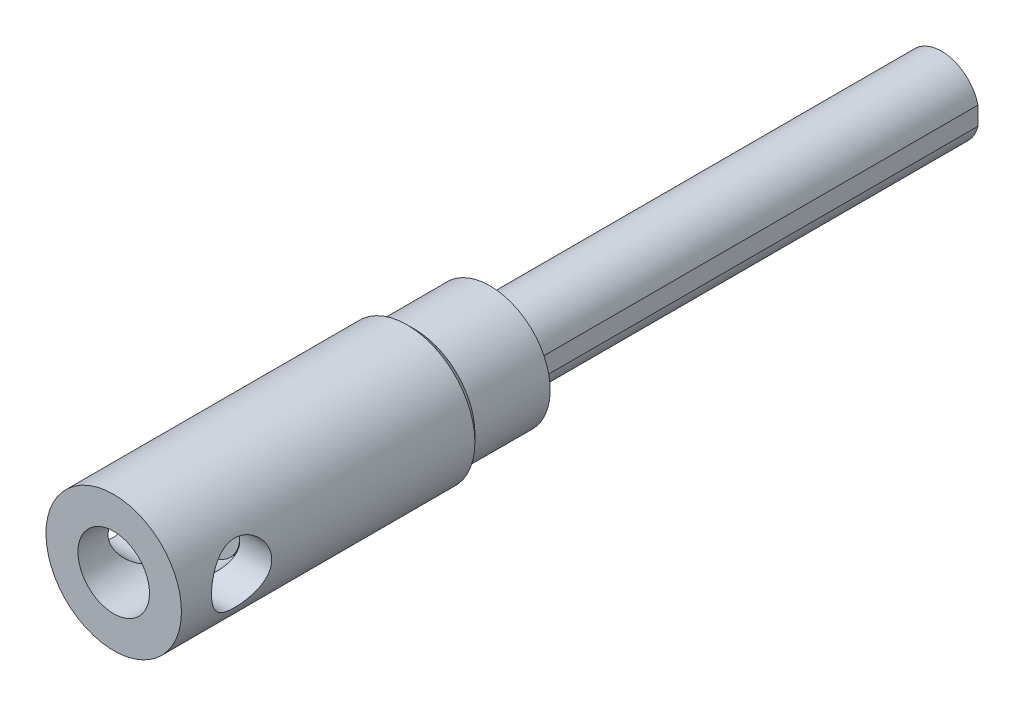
ISO-10303-21;
HEADER;
FILE_DESCRIPTION(('STEP AP214'),'2;1');
FILE_NAME('part.step','',(''),(''),'','','');
FILE_SCHEMA(('AUTOMOTIVE_DESIGN { 1 0 10303 214 1 1 1 1 }'));
ENDSEC;
DATA;
#1=APPLICATION_CONTEXT('core data for automotive mechanical design processes');
#2=APPLICATION_PROTOCOL_DEFINITION('international standard','automotive_design',2000,#1);
#3=PRODUCT_CONTEXT('',#1,'mechanical');
#4=PRODUCT('Part','Part','',(#3));
#5=PRODUCT_RELATED_PRODUCT_CATEGORY('part','',(#4));
#6=PRODUCT_DEFINITION_FORMATION('','',#4);
#7=PRODUCT_DEFINITION_CONTEXT('part definition',#1,'design');
#8=PRODUCT_DEFINITION('design','',#6,#7);
#9=PRODUCT_DEFINITION_SHAPE('','',#8);
#10=(LENGTH_UNIT() NAMED_UNIT(*) SI_UNIT(.MILLI.,.METRE.));
#11=(NAMED_UNIT(*) PLANE_ANGLE_UNIT() SI_UNIT($,.RADIAN.));
#12=(NAMED_UNIT(*) SI_UNIT($,.STERADIAN.) SOLID_ANGLE_UNIT());
#13=UNCERTAINTY_MEASURE_WITH_UNIT(LENGTH_MEASURE(1.E-05),#10,'distance_accuracy_value','');
#14=(GEOMETRIC_REPRESENTATION_CONTEXT(3) GLOBAL_UNCERTAINTY_ASSIGNED_CONTEXT((#13)) GLOBAL_UNIT_ASSIGNED_CONTEXT((#10,
#11,#12)) REPRESENTATION_CONTEXT('',''));
#15=CARTESIAN_POINT('',(0.,0.,0.));
#16=DIRECTION('',(0.,0.,1.));
#17=DIRECTION('',(1.,0.,0.));
#18=AXIS2_PLACEMENT_3D('',#15,#16,#17);
#19=CARTESIAN_POINT('',(2.3094010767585,0.,95.));
#20=DIRECTION('',(-0.866025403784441,0.5,0.));
#21=DIRECTION('',(-0.5,-0.866025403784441,0.));
#22=AXIS2_PLACEMENT_3D('',#19,#20,#21);
#23=PLANE('',#22);
#24=DIRECTION('',(0.,0.,1.));
#25=VECTOR('',#24,1.);
#26=CARTESIAN_POINT('',(1.15470053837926,-2.,95.));
#27=LINE('',#26,#25);
#28=CARTESIAN_POINT('',(1.15470053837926,-2.,95.));
#29=VERTEX_POINT('',#28);
#30=CARTESIAN_POINT('',(1.15470053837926,-2.,97.5));
#31=VERTEX_POINT('',#30);
#32=EDGE_CURVE('E291',#29,#31,#27,.T.);
#33=ORIENTED_EDGE('',*,*,#32,.T.);
#34=DIRECTION('',(-0.5,-0.866025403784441,0.));
#35=VECTOR('',#34,1.);
#36=CARTESIAN_POINT('',(2.3094010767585,0.,97.5));
#37=LINE('',#36,#35);
#38=CARTESIAN_POINT('',(2.3094010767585,0.,97.5));
#39=VERTEX_POINT('',#38);
#40=EDGE_CURVE('E29',#39,#31,#37,.T.);
#41=ORIENTED_EDGE('',*,*,#40,.F.);
#42=DIRECTION('',(0.,0.,1.));
#43=VECTOR('',#42,1.);
#44=CARTESIAN_POINT('',(2.3094010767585,0.,95.));
#45=LINE('',#44,#43);
#46=CARTESIAN_POINT('',(2.3094010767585,0.,95.));
#47=VERTEX_POINT('',#46);
#48=EDGE_CURVE('E33',#47,#39,#45,.T.);
#49=ORIENTED_EDGE('',*,*,#48,.F.);
#50=DIRECTION('',(-0.5,-0.866025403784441,0.));
#51=VECTOR('',#50,1.);
#52=CARTESIAN_POINT('',(2.3094010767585,0.,95.));
#53=LINE('',#52,#51);
#54=EDGE_CURVE('E252',#47,#29,#53,.T.);
#55=ORIENTED_EDGE('',*,*,#54,.T.);
#56=EDGE_LOOP('',(#33,#41,#49,#55));
#57=FACE_BOUND('',#56,.T.);
#58=ADVANCED_FACE('F14',(#57),#23,.T.);
#59=CARTESIAN_POINT('',(-1.15470053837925,-2.,95.));
#60=DIRECTION('',(0.,-1.,0.));
#61=DIRECTION('',(0.,0.,-1.));
#62=AXIS2_PLACEMENT_3D('',#59,#60,#61);
#63=PLANE('',#62);
#64=DIRECTION('',(0.,0.,1.));
#65=VECTOR('',#64,1.);
#66=CARTESIAN_POINT('',(-1.15470053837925,-2.,95.));
#67=LINE('',#66,#65);
#68=CARTESIAN_POINT('',(-1.15470053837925,-2.,95.));
#69=VERTEX_POINT('',#68);
#70=CARTESIAN_POINT('',(-1.15470053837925,-2.,97.5));
#71=VERTEX_POINT('',#70);
#72=EDGE_CURVE('E289',#69,#71,#67,.T.);
#73=ORIENTED_EDGE('',*,*,#72,.T.);
#74=DIRECTION('',(1.,0.,0.));
#75=VECTOR('',#74,1.);
#76=CARTESIAN_POINT('',(-1.15470053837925,-2.,97.5));
#77=LINE('',#76,#75);
#78=EDGE_CURVE('E262',#71,#31,#77,.T.);
#79=ORIENTED_EDGE('',*,*,#78,.T.);
#80=ORIENTED_EDGE('',*,*,#32,.F.);
#81=DIRECTION('',(1.,0.,0.));
#82=VECTOR('',#81,1.);
#83=CARTESIAN_POINT('',(-1.15470053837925,-2.,95.));
#84=LINE('',#83,#82);
#85=EDGE_CURVE('E278',#69,#29,#84,.T.);
#86=ORIENTED_EDGE('',*,*,#85,.F.);
#87=EDGE_LOOP('',(#73,#79,#80,#86));
#88=FACE_BOUND('',#87,.T.);
#89=ADVANCED_FACE('F166',(#88),#63,.F.);
#90=CARTESIAN_POINT('',(-2.3094010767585,0.,95.));
#91=DIRECTION('',(-0.866025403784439,-0.5,0.));
#92=DIRECTION('',(0.5,-0.866025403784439,0.));
#93=AXIS2_PLACEMENT_3D('',#90,#91,#92);
#94=PLANE('',#93);
#95=DIRECTION('',(0.,0.,1.));
#96=VECTOR('',#95,1.);
#97=CARTESIAN_POINT('',(-2.3094010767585,0.,95.));
#98=LINE('',#97,#96);
#99=CARTESIAN_POINT('',(-2.3094010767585,0.,95.));
#100=VERTEX_POINT('',#99);
#101=CARTESIAN_POINT('',(-2.3094010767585,0.,97.5));
#102=VERTEX_POINT('',#101);
#103=EDGE_CURVE('E287',#100,#102,#98,.T.);
#104=ORIENTED_EDGE('',*,*,#103,.T.);
#105=DIRECTION('',(0.5,-0.866025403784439,0.));
#106=VECTOR('',#105,1.);
#107=CARTESIAN_POINT('',(-2.3094010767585,0.,97.5));
#108=LINE('',#107,#106);
#109=EDGE_CURVE('E259',#102,#71,#108,.T.);
#110=ORIENTED_EDGE('',*,*,#109,.T.);
#111=ORIENTED_EDGE('',*,*,#72,.F.);
#112=DIRECTION('',(0.5,-0.866025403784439,0.));
#113=VECTOR('',#112,1.);
#114=CARTESIAN_POINT('',(-2.3094010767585,0.,95.));
#115=LINE('',#114,#113);
#116=EDGE_CURVE('E275',#100,#69,#115,.T.);
#117=ORIENTED_EDGE('',*,*,#116,.F.);
#118=EDGE_LOOP('',(#104,#110,#111,#117));
#119=FACE_BOUND('',#118,.T.);
#120=ADVANCED_FACE('F171',(#119),#94,.F.);
#121=CARTESIAN_POINT('',(-2.3094010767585,0.,95.));
#122=DIRECTION('',(0.866025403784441,-0.5,0.));
#123=DIRECTION('',(0.5,0.866025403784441,0.));
#124=AXIS2_PLACEMENT_3D('',#121,#122,#123);
#125=PLANE('',#124);
#126=DIRECTION('',(0.,0.,1.));
#127=VECTOR('',#126,1.);
#128=CARTESIAN_POINT('',(-1.15470053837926,2.,95.));
#129=LINE('',#128,#127);
#130=CARTESIAN_POINT('',(-1.15470053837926,2.,95.));
#131=VERTEX_POINT('',#130);
#132=CARTESIAN_POINT('',(-1.15470053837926,2.,97.5));
#133=VERTEX_POINT('',#132);
#134=EDGE_CURVE('E285',#131,#133,#129,.T.);
#135=ORIENTED_EDGE('',*,*,#134,.T.);
#136=DIRECTION('',(0.5,0.866025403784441,0.));
#137=VECTOR('',#136,1.);
#138=CARTESIAN_POINT('',(-2.3094010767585,0.,97.5));
#139=LINE('',#138,#137);
#140=EDGE_CURVE('E256',#102,#133,#139,.T.);
#141=ORIENTED_EDGE('',*,*,#140,.F.);
#142=ORIENTED_EDGE('',*,*,#103,.F.);
#143=DIRECTION('',(0.5,0.866025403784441,0.));
#144=VECTOR('',#143,1.);
#145=CARTESIAN_POINT('',(-2.3094010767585,0.,95.));
#146=LINE('',#145,#144);
#147=EDGE_CURVE('E272',#100,#131,#146,.T.);
#148=ORIENTED_EDGE('',*,*,#147,.T.);
#149=EDGE_LOOP('',(#135,#141,#142,#148));
#150=FACE_BOUND('',#149,.T.);
#151=ADVANCED_FACE('F184',(#150),#125,.T.);
#152=CARTESIAN_POINT('',(1.15470053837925,2.,95.));
#153=DIRECTION('',(0.,1.,0.));
#154=DIRECTION('',(-1.,0.,0.));
#155=AXIS2_PLACEMENT_3D('',#152,#153,#154);
#156=PLANE('',#155);
#157=DIRECTION('',(0.,0.,1.));
#158=VECTOR('',#157,1.);
#159=CARTESIAN_POINT('',(1.15470053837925,2.,95.));
#160=LINE('',#159,#158);
#161=CARTESIAN_POINT('',(1.15470053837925,2.,95.));
#162=VERTEX_POINT('',#161);
#163=CARTESIAN_POINT('',(1.15470053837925,2.,97.5));
#164=VERTEX_POINT('',#163);
#165=EDGE_CURVE('E283',#162,#164,#160,.T.);
#166=ORIENTED_EDGE('',*,*,#165,.T.);
#167=DIRECTION('',(-1.,0.,0.));
#168=VECTOR('',#167,1.);
#169=CARTESIAN_POINT('',(1.15470053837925,2.,97.5));
#170=LINE('',#169,#168);
#171=EDGE_CURVE('E253',#164,#133,#170,.T.);
#172=ORIENTED_EDGE('',*,*,#171,.T.);
#173=ORIENTED_EDGE('',*,*,#134,.F.);
#174=DIRECTION('',(-1.,0.,0.));
#175=VECTOR('',#174,1.);
#176=CARTESIAN_POINT('',(1.15470053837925,2.,95.));
#177=LINE('',#176,#175);
#178=EDGE_CURVE('E269',#162,#131,#177,.T.);
#179=ORIENTED_EDGE('',*,*,#178,.F.);
#180=EDGE_LOOP('',(#166,#172,#173,#179));
#181=FACE_BOUND('',#180,.T.);
#182=ADVANCED_FACE('F180',(#181),#156,.F.);
#183=CARTESIAN_POINT('',(2.3094010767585,0.,95.));
#184=DIRECTION('',(0.866025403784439,0.5,0.));
#185=DIRECTION('',(-0.5,0.866025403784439,0.));
#186=AXIS2_PLACEMENT_3D('',#183,#184,#185);
#187=PLANE('',#186);
#188=DIRECTION('',(-0.5,0.866025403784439,0.));
#189=VECTOR('',#188,1.);
#190=CARTESIAN_POINT('',(2.3094010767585,0.,95.));
#191=LINE('',#190,#189);
#192=EDGE_CURVE('E266',#47,#162,#191,.T.);
#193=ORIENTED_EDGE('',*,*,#192,.F.);
#194=ORIENTED_EDGE('',*,*,#48,.T.);
#195=DIRECTION('',(-0.5,0.866025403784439,0.));
#196=VECTOR('',#195,1.);
#197=CARTESIAN_POINT('',(2.3094010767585,0.,97.5));
#198=LINE('',#197,#196);
#199=EDGE_CURVE('E249',#39,#164,#198,.T.);
#200=ORIENTED_EDGE('',*,*,#199,.T.);
#201=ORIENTED_EDGE('',*,*,#165,.F.);
#202=EDGE_LOOP('',(#193,#194,#200,#201));
#203=FACE_BOUND('',#202,.T.);
#204=ADVANCED_FACE('F177',(#203),#187,.F.);
#205=CARTESIAN_POINT('',(3.46410161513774,2.,95.));
#206=DIRECTION('',(0.,0.,-1.));
#207=DIRECTION('',(0.,1.,0.));
#208=AXIS2_PLACEMENT_3D('',#205,#206,#207);
#209=PLANE('',#208);
#210=ORIENTED_EDGE('',*,*,#54,.F.);
#211=ORIENTED_EDGE('',*,*,#192,.T.);
#212=ORIENTED_EDGE('',*,*,#178,.T.);
#213=ORIENTED_EDGE('',*,*,#147,.F.);
#214=ORIENTED_EDGE('',*,*,#116,.T.);
#215=ORIENTED_EDGE('',*,*,#85,.T.);
#216=EDGE_LOOP('',(#210,#211,#212,#213,#214,#215));
#217=FACE_BOUND('',#216,.T.);
#218=ADVANCED_FACE('F176',(#217),#209,.F.);
#219=CARTESIAN_POINT('',(0.,0.,97.5));
#220=DIRECTION('',(0.,0.,1.));
#221=DIRECTION('',(0.,-1.,0.));
#222=AXIS2_PLACEMENT_3D('',#219,#220,#221);
#223=PLANE('',#222);
#224=CARTESIAN_POINT('',(0.,0.,97.5));
#225=DIRECTION('',(0.,0.,1.));
#226=DIRECTION('',(0.,-1.,0.));
#227=AXIS2_PLACEMENT_3D('',#224,#225,#226);
#228=CIRCLE('',#227,4.25);
#229=CARTESIAN_POINT('',(0.,-4.25,97.5));
#230=VERTEX_POINT('',#229);
#231=EDGE_CURVE('E9',#230,#230,#228,.T.);
#232=ORIENTED_EDGE('',*,*,#231,.T.);
#233=EDGE_LOOP('',(#232));
#234=FACE_BOUND('',#233,.T.);
#235=ORIENTED_EDGE('',*,*,#199,.F.);
#236=ORIENTED_EDGE('',*,*,#40,.T.);
#237=ORIENTED_EDGE('',*,*,#78,.F.);
#238=ORIENTED_EDGE('',*,*,#109,.F.);
#239=ORIENTED_EDGE('',*,*,#140,.T.);
#240=ORIENTED_EDGE('',*,*,#171,.F.);
#241=EDGE_LOOP('',(#235,#236,#237,#238,#239,#240));
#242=FACE_BOUND('',#241,.T.);
#243=ADVANCED_FACE('F16',(#234,#242),#223,.T.);
#244=CARTESIAN_POINT('',(0.,0.,92.5));
#245=DIRECTION('',(0.,0.,1.));
#246=DIRECTION('',(0.,-1.,0.));
#247=AXIS2_PLACEMENT_3D('',#244,#245,#246);
#248=CYLINDRICAL_SURFACE('',#247,4.25);
#249=CARTESIAN_POINT('',(0.,0.,92.5));
#250=DIRECTION('',(0.,0.,1.));
#251=DIRECTION('',(0.,-1.,0.));
#252=AXIS2_PLACEMENT_3D('',#249,#250,#251);
#253=CIRCLE('',#252,4.25);
#254=CARTESIAN_POINT('',(0.,-4.25,92.5));
#255=VERTEX_POINT('',#254);
#256=EDGE_CURVE('E22',#255,#255,#253,.T.);
#257=ORIENTED_EDGE('',*,*,#256,.T.);
#258=EDGE_LOOP('',(#257));
#259=FACE_BOUND('',#258,.T.);
#260=ORIENTED_EDGE('',*,*,#231,.F.);
#261=EDGE_LOOP('',(#260));
#262=FACE_BOUND('',#261,.T.);
#263=ADVANCED_FACE('F191',(#259,#262),#248,.T.);
#264=CARTESIAN_POINT('',(0.,0.,0.));
#265=DIRECTION('',(0.,0.,1.));
#266=DIRECTION('',(-1.,0.,0.));
#267=AXIS2_PLACEMENT_3D('',#264,#265,#266);
#268=PLANE('',#267);
#269=DIRECTION('',(0.,-1.,0.));
#270=VECTOR('',#269,1.);
#271=CARTESIAN_POINT('',(4.85,-1.21552457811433,0.));
#272=LINE('',#271,#270);
#273=CARTESIAN_POINT('',(4.85,1.21552457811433,0.));
#274=VERTEX_POINT('',#273);
#275=CARTESIAN_POINT('',(4.85,-1.21552457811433,0.));
#276=VERTEX_POINT('',#275);
#277=EDGE_CURVE('E91',#274,#276,#272,.T.);
#278=ORIENTED_EDGE('',*,*,#277,.T.);
#279=CARTESIAN_POINT('',(0.,0.,0.));
#280=DIRECTION('',(0.,0.,1.));
#281=DIRECTION('',(-1.,0.,0.));
#282=AXIS2_PLACEMENT_3D('',#279,#280,#281);
#283=CIRCLE('',#282,5.);
#284=EDGE_CURVE('E83',#274,#276,#283,.T.);
#285=ORIENTED_EDGE('',*,*,#284,.F.);
#286=EDGE_LOOP('',(#278,#285));
#287=FACE_BOUND('',#286,.T.);
#288=ADVANCED_FACE('F95',(#287),#268,.F.);
#289=CARTESIAN_POINT('',(4.85,-1.21552457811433,80.));
#290=DIRECTION('',(1.,0.,0.));
#291=DIRECTION('',(0.,0.,1.));
#292=AXIS2_PLACEMENT_3D('',#289,#290,#291);
#293=PLANE('',#292);
#294=DIRECTION('',(0.,1.,0.));
#295=VECTOR('',#294,1.);
#296=CARTESIAN_POINT('',(4.85,8.,60.));
#297=LINE('',#296,#295);
#298=CARTESIAN_POINT('',(4.85,-1.21552457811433,60.));
#299=VERTEX_POINT('',#298);
#300=CARTESIAN_POINT('',(4.85,1.21552457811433,60.));
#301=VERTEX_POINT('',#300);
#302=EDGE_CURVE('E246',#299,#301,#297,.T.);
#303=ORIENTED_EDGE('',*,*,#302,.F.);
#304=DIRECTION('',(0.,0.,-1.));
#305=VECTOR('',#304,1.);
#306=CARTESIAN_POINT('',(4.85,-1.21552457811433,80.));
#307=LINE('',#306,#305);
#308=EDGE_CURVE('E88',#299,#276,#307,.T.);
#309=ORIENTED_EDGE('',*,*,#308,.T.);
#310=ORIENTED_EDGE('',*,*,#277,.F.);
#311=DIRECTION('',(0.,0.,-1.));
#312=VECTOR('',#311,1.);
#313=CARTESIAN_POINT('',(4.85,1.21552457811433,80.));
#314=LINE('',#313,#312);
#315=EDGE_CURVE('E78',#301,#274,#314,.T.);
#316=ORIENTED_EDGE('',*,*,#315,.F.);
#317=EDGE_LOOP('',(#303,#309,#310,#316));
#318=FACE_BOUND('',#317,.T.);
#319=ADVANCED_FACE('F92',(#318),#293,.T.);
#320=CARTESIAN_POINT('',(0.,0.,80.));
#321=DIRECTION('',(0.,0.,-1.));
#322=DIRECTION('',(1.,0.,0.));
#323=AXIS2_PLACEMENT_3D('',#320,#321,#322);
#324=CYLINDRICAL_SURFACE('',#323,5.);
#325=ORIENTED_EDGE('',*,*,#308,.F.);
#326=CARTESIAN_POINT('',(0.,0.,60.));
#327=DIRECTION('',(0.,0.,1.));
#328=DIRECTION('',(1.025516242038E-09,-1.,0.));
#329=AXIS2_PLACEMENT_3D('',#326,#327,#328);
#330=CIRCLE('',#329,5.);
#331=EDGE_CURVE('E84',#299,#301,#330,.F.);
#332=ORIENTED_EDGE('',*,*,#331,.T.);
#333=ORIENTED_EDGE('',*,*,#315,.T.);
#334=ORIENTED_EDGE('',*,*,#284,.T.);
#335=EDGE_LOOP('',(#325,#332,#333,#334));
#336=FACE_BOUND('',#335,.T.);
#337=ADVANCED_FACE('F81',(#336),#324,.T.);
#338=CARTESIAN_POINT('',(0.,8.,60.));
#339=DIRECTION('',(0.,0.,1.));
#340=DIRECTION('',(0.,-1.,0.));
#341=AXIS2_PLACEMENT_3D('',#338,#339,#340);
#342=PLANE('',#341);
#343=CARTESIAN_POINT('',(0.,0.,60.));
#344=DIRECTION('',(0.,0.,-1.));
#345=DIRECTION('',(0.,1.,0.));
#346=AXIS2_PLACEMENT_3D('',#343,#344,#345);
#347=CIRCLE('',#346,8.);
#348=CARTESIAN_POINT('',(0.,8.,60.));
#349=VERTEX_POINT('',#348);
#350=EDGE_CURVE('E222',#349,#349,#347,.T.);
#351=ORIENTED_EDGE('',*,*,#350,.T.);
#352=EDGE_LOOP('',(#351));
#353=FACE_BOUND('',#352,.T.);
#354=ORIENTED_EDGE('',*,*,#331,.F.);
#355=ORIENTED_EDGE('',*,*,#302,.T.);
#356=EDGE_LOOP('',(#354,#355));
#357=FACE_BOUND('',#356,.T.);
#358=ADVANCED_FACE('F126',(#353,#357),#342,.F.);
#359=CARTESIAN_POINT('',(0.,0.,60.));
#360=DIRECTION('',(0.,0.,-1.));
#361=DIRECTION('',(0.,1.,0.));
#362=AXIS2_PLACEMENT_3D('',#359,#360,#361);
#363=CYLINDRICAL_SURFACE('',#362,8.);
#364=ORIENTED_EDGE('',*,*,#350,.F.);
#365=EDGE_LOOP('',(#364));
#366=FACE_BOUND('',#365,.T.);
#367=CARTESIAN_POINT('',(0.,0.,70.));
#368=DIRECTION('',(0.,0.,-1.));
#369=DIRECTION('',(0.,1.,0.));
#370=AXIS2_PLACEMENT_3D('',#367,#368,#369);
#371=CIRCLE('',#370,8.);
#372=CARTESIAN_POINT('',(0.,8.,70.));
#373=VERTEX_POINT('',#372);
#374=EDGE_CURVE('E220',#373,#373,#371,.T.);
#375=ORIENTED_EDGE('',*,*,#374,.T.);
#376=EDGE_LOOP('',(#375));
#377=FACE_BOUND('',#376,.T.);
#378=ADVANCED_FACE('F151',(#366,#377),#363,.T.);
#379=CARTESIAN_POINT('',(0.,0.,70.));
#380=DIRECTION('',(0.,0.,1.));
#381=DIRECTION('',(0.,-1.,0.));
#382=AXIS2_PLACEMENT_3D('',#379,#380,#381);
#383=CONICAL_SURFACE('',#382,8.,0.785398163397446);
#384=CARTESIAN_POINT('',(0.,0.,71.));
#385=DIRECTION('',(0.,0.,1.));
#386=DIRECTION('',(0.,-1.,0.));
#387=AXIS2_PLACEMENT_3D('',#384,#385,#386);
#388=CIRCLE('',#387,9.);
#389=CARTESIAN_POINT('',(0.,-9.,71.));
#390=VERTEX_POINT('',#389);
#391=EDGE_CURVE('E145',#390,#390,#388,.T.);
#392=ORIENTED_EDGE('',*,*,#391,.F.);
#393=EDGE_LOOP('',(#392));
#394=FACE_BOUND('',#393,.T.);
#395=ORIENTED_EDGE('',*,*,#374,.F.);
#396=EDGE_LOOP('',(#395));
#397=FACE_BOUND('',#396,.T.);
#398=ADVANCED_FACE('F124',(#394,#397),#383,.T.);
#399=CARTESIAN_POINT('',(0.,0.,60.));
#400=DIRECTION('',(0.,0.,-1.));
#401=DIRECTION('',(0.,1.,0.));
#402=AXIS2_PLACEMENT_3D('',#399,#400,#401);
#403=CYLINDRICAL_SURFACE('',#402,9.);
#404=ORIENTED_EDGE('',*,*,#391,.T.);
#405=EDGE_LOOP('',(#404));
#406=FACE_BOUND('',#405,.T.);
#407=CARTESIAN_POINT('',(-9.,0.,106.));
#408=CARTESIAN_POINT('',(-8.99999931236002,-0.106543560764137,105.999999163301));
#409=CARTESIAN_POINT('',(-8.99810295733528,-0.213114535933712,105.995737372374));
#410=CARTESIAN_POINT('',(-8.99056534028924,-0.425487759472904,105.978733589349));
#411=CARTESIAN_POINT('',(-8.9849219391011,-0.531289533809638,105.965986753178));
#412=CARTESIAN_POINT('',(-8.97002203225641,-0.741497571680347,105.932115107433));
#413=CARTESIAN_POINT('',(-8.96075877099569,-0.845900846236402,105.910974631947));
#414=CARTESIAN_POINT('',(-8.93886560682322,-1.05237393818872,105.860547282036));
#415=CARTESIAN_POINT('',(-8.92623432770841,-1.15444278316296,105.831257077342));
#416=CARTESIAN_POINT('',(-8.88385509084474,-1.45528706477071,105.731826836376));
#417=CARTESIAN_POINT('',(-8.84954694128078,-1.64969223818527,105.649964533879));
#418=CARTESIAN_POINT('',(-8.7720569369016,-2.02169397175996,105.457842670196));
#419=CARTESIAN_POINT('',(-8.7288771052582,-2.1992943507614,105.34758958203));
#420=CARTESIAN_POINT('',(-8.63520005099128,-2.5429519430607,105.095329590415));
#421=CARTESIAN_POINT('',(-8.58444255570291,-2.707964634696,104.951994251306));
#422=CARTESIAN_POINT('',(-8.48237167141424,-3.01251193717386,104.640513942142));
#423=CARTESIAN_POINT('',(-8.43105797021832,-3.15203136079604,104.472354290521));
#424=CARTESIAN_POINT('',(-8.33031613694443,-3.40970641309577,104.10407902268));
#425=CARTESIAN_POINT('',(-8.28116793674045,-3.52616342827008,103.902678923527));
#426=CARTESIAN_POINT('',(-8.21620901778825,-3.67379855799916,103.58644164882));
#427=CARTESIAN_POINT('',(-8.19601074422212,-3.7185134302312,103.478630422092));
#428=CARTESIAN_POINT('',(-8.15924882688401,-3.79849956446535,103.258980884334));
#429=CARTESIAN_POINT('',(-8.14268322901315,-3.83377590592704,103.147144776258));
#430=CARTESIAN_POINT('',(-8.11458487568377,-3.89288163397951,102.926209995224));
#431=CARTESIAN_POINT('',(-8.10283476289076,-3.91721191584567,102.8172725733));
#432=CARTESIAN_POINT('',(-8.08362129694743,-3.95670961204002,102.59742166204));
#433=CARTESIAN_POINT('',(-8.07615587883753,-3.97188144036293,102.486509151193));
#434=CARTESIAN_POINT('',(-8.06579894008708,-3.99287182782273,102.263627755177));
#435=CARTESIAN_POINT('',(-8.06290582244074,-3.99869365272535,102.151659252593));
#436=CARTESIAN_POINT('',(-8.06180452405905,-4.0009136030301,101.927610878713));
#437=CARTESIAN_POINT('',(-8.06359604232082,-3.9973123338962,101.815531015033));
#438=CARTESIAN_POINT('',(-8.0714233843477,-3.98148137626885,101.602272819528));
#439=CARTESIAN_POINT('',(-8.07706352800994,-3.97005575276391,101.501019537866));
#440=CARTESIAN_POINT('',(-8.09197245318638,-3.93957606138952,101.299928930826));
#441=CARTESIAN_POINT('',(-8.10124240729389,-3.92051952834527,101.200092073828));
#442=CARTESIAN_POINT('',(-8.13408651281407,-3.85217674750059,100.903762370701));
#443=CARTESIAN_POINT('',(-8.16270181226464,-3.79170447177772,100.710282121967));
#444=CARTESIAN_POINT('',(-8.23081734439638,-3.64150006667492,100.332101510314));
#445=CARTESIAN_POINT('',(-8.27054749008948,-3.55114161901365,100.147695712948));
#446=CARTESIAN_POINT('',(-8.35638151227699,-3.3441634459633,99.7958565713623));
#447=CARTESIAN_POINT('',(-8.40248806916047,-3.22753266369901,99.6284304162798));
#448=CARTESIAN_POINT('',(-8.50133279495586,-2.95801583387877,99.2981702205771));
#449=CARTESIAN_POINT('',(-8.5542794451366,-2.80270476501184,99.1373723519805));
#450=CARTESIAN_POINT('',(-8.65709798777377,-2.46687651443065,98.8433658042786));
#451=CARTESIAN_POINT('',(-8.70696894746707,-2.28635173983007,98.7101654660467));
#452=CARTESIAN_POINT('',(-8.79984898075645,-1.89830549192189,98.4715733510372));
#453=CARTESIAN_POINT('',(-8.84261183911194,-1.69014406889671,98.3671192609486));
#454=CARTESIAN_POINT('',(-8.91451161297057,-1.2568148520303,98.1954461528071));
#455=CARTESIAN_POINT('',(-8.94365711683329,-1.03165788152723,98.1282036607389));
#456=CARTESIAN_POINT('',(-8.98336516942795,-0.587641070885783,98.0373762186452));
#457=CARTESIAN_POINT('',(-8.99508492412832,-0.369442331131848,98.0110665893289));
#458=CARTESIAN_POINT('',(-9.00240007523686,0.0685540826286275,97.994593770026));
#459=CARTESIAN_POINT('',(-8.99800094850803,0.288351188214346,98.0044183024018));
#460=CARTESIAN_POINT('',(-8.97430591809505,0.709814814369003,98.0580870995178));
#461=CARTESIAN_POINT('',(-8.95589038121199,0.911792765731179,98.0999216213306));
#462=CARTESIAN_POINT('',(-8.90701082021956,1.30558421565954,98.2135161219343));
#463=CARTESIAN_POINT('',(-8.87654533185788,1.49739647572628,98.2852797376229));
#464=CARTESIAN_POINT('',(-8.80524764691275,1.8722078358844,98.4589771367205));
#465=CARTESIAN_POINT('',(-8.76412168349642,2.05474529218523,98.5617823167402));
#466=CARTESIAN_POINT('',(-8.67576208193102,2.40063957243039,98.7937052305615));
#467=CARTESIAN_POINT('',(-8.62852578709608,2.56398799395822,98.9228344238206));
#468=CARTESIAN_POINT('',(-8.52825739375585,2.88073032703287,99.2158239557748));
#469=CARTESIAN_POINT('',(-8.47506500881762,3.03226090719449,99.3816446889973));
#470=CARTESIAN_POINT('',(-8.37207677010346,3.30602071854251,99.7371478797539));
#471=CARTESIAN_POINT('',(-8.32228212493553,3.42823956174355,99.9268387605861));
#472=CARTESIAN_POINT('',(-8.25404075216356,3.58807434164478,100.228245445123));
#473=CARTESIAN_POINT('',(-8.23214803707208,3.63788387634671,100.332879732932));
#474=CARTESIAN_POINT('',(-8.19154569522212,3.72840991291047,100.546588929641));
#475=CARTESIAN_POINT('',(-8.17283464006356,3.76913049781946,100.655661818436));
#476=CARTESIAN_POINT('',(-8.13929816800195,3.84101557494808,100.877421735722));
#477=CARTESIAN_POINT('',(-8.12447050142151,3.87218560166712,100.990106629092));
#478=CARTESIAN_POINT('',(-8.0992771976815,3.92460929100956,101.218249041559));
#479=CARTESIAN_POINT('',(-8.08891105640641,3.94586407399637,101.33370624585));
#480=CARTESIAN_POINT('',(-8.07374935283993,3.97678770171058,101.556479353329));
#481=CARTESIAN_POINT('',(-8.06855529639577,3.98728755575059,101.663653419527));
#482=CARTESIAN_POINT('',(-8.06245450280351,3.99960939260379,101.87865985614));
#483=CARTESIAN_POINT('',(-8.06154919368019,4.00142848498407,101.986492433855));
#484=CARTESIAN_POINT('',(-8.06406616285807,3.99635429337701,102.201844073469));
#485=CARTESIAN_POINT('',(-8.06748593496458,3.98946605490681,102.309363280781));
#486=CARTESIAN_POINT('',(-8.07851431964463,3.96708318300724,102.523297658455));
#487=CARTESIAN_POINT('',(-8.08612450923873,3.95158530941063,102.629712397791));
#488=CARTESIAN_POINT('',(-8.11370655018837,3.89481025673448,102.933253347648));
#489=CARTESIAN_POINT('',(-8.13866591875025,3.8428451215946,103.128043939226));
#490=CARTESIAN_POINT('',(-8.19957700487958,3.71108221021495,103.505998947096));
#491=CARTESIAN_POINT('',(-8.23553189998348,3.6312763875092,103.689159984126));
#492=CARTESIAN_POINT('',(-8.31722161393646,3.44024324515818,104.051664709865));
#493=CARTESIAN_POINT('',(-8.36343549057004,3.32733013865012,104.230011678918));
#494=CARTESIAN_POINT('',(-8.45929191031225,3.07546946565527,104.566253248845));
#495=CARTESIAN_POINT('',(-8.50893588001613,2.93651102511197,104.724139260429));
#496=CARTESIAN_POINT('',(-8.61126362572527,2.62217220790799,105.029240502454));
#497=CARTESIAN_POINT('',(-8.66383343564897,2.4446691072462,105.174314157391));
#498=CARTESIAN_POINT('',(-8.76186799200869,2.06586629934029,105.432884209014));
#499=CARTESIAN_POINT('',(-8.80732948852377,1.86455578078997,105.546366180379));
#500=CARTESIAN_POINT('',(-8.86614466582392,1.55009155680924,105.689219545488));
#501=CARTESIAN_POINT('',(-8.88411858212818,1.44376115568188,105.732125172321));
#502=CARTESIAN_POINT('',(-8.91658812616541,1.22735110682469,105.808773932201));
#503=CARTESIAN_POINT('',(-8.93108542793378,1.11727329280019,105.842521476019));
#504=CARTESIAN_POINT('',(-8.9561409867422,0.894475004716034,105.900402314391));
#505=CARTESIAN_POINT('',(-8.96670865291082,0.781761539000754,105.924558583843));
#506=CARTESIAN_POINT('',(-8.98362931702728,0.554414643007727,105.963066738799));
#507=CARTESIAN_POINT('',(-8.98998524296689,0.439782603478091,105.977425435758));
#508=CARTESIAN_POINT('',(-8.99608997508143,0.270722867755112,105.99119614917));
#509=CARTESIAN_POINT('',(-8.99755504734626,0.216644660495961,105.994496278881));
#510=CARTESIAN_POINT('',(-8.99951024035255,0.108380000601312,105.998898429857));
#511=CARTESIAN_POINT('',(-9.00000034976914,0.0541935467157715,106.000000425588));
#512=CARTESIAN_POINT('',(-9.,0.,106.));
#513=B_SPLINE_CURVE_WITH_KNOTS('',3,(#407,#408,#409,#410,#411,#412,#413,#414,#415,#416,#417,
#418,#419,#420,#421,#422,#423,#424,#425,#426,#427,#428,#429,#430,#431,#432,#433,#434,#435,#436,
#437,#438,#439,#440,#441,#442,#443,#444,#445,#446,#447,#448,#449,#450,#451,#452,#453,#454,#455,
#456,#457,#458,#459,#460,#461,#462,#463,#464,#465,#466,#467,#468,#469,#470,#471,#472,#473,#474,
#475,#476,#477,#478,#479,#480,#481,#482,#483,#484,#485,#486,#487,#488,#489,#490,#491,#492,#493,
#494,#495,#496,#497,#498,#499,#500,#501,#502,#503,#504,#505,#506,#507,#508,#509,#510,#511,#512),
.UNSPECIFIED.,.T.,.F.,(4,2,2,2,2,2,2,2,2,2,2,2,2,2,2,2,2,2,2,2,2,2,2,2,2,2,2,2,2,2,2,2,2,2,2,2,
2,2,2,2,2,2,2,2,2,2,2,2,2,2,2,2,4),(0.,0.319575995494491,0.639334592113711,0.959692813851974,
1.28018213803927,1.91817504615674,2.55602262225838,3.22626867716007,3.89691272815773,
4.60627839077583,4.96122462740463,5.31597945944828,5.65223953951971,5.98833742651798,
6.32431789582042,6.66027677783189,6.9660595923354,7.27194127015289,7.88320420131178,
8.50818797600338,9.13343527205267,9.81959120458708,10.5059542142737,11.2125921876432,
11.9187838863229,12.5755805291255,13.2321540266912,13.8505799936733,14.4690811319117,
15.1068781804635,15.7449534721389,16.4344546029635,17.1241997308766,17.4776093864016,
17.8308599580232,18.1839054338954,18.5369110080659,18.8599212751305,19.1830390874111,
19.5059697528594,19.8290220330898,20.4355356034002,21.042224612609,21.6877902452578,
22.3336260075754,23.0359566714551,23.7386075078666,24.0863996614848,24.4340240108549,
24.7808105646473,25.1273557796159,25.2899067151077,25.4524595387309),.UNSPECIFIED.);
#514=CARTESIAN_POINT('',(-9.,0.,106.));
#515=VERTEX_POINT('',#514);
#516=EDGE_CURVE('E139',#515,#515,#513,.T.);
#517=ORIENTED_EDGE('',*,*,#516,.T.);
#518=EDGE_LOOP('',(#517));
#519=FACE_BOUND('',#518,.T.);
#520=CARTESIAN_POINT('',(9.,0.,106.));
#521=CARTESIAN_POINT('',(8.99999931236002,0.106543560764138,105.999999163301));
#522=CARTESIAN_POINT('',(8.99810295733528,0.213114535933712,105.995737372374));
#523=CARTESIAN_POINT('',(8.99056534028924,0.425487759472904,105.978733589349));
#524=CARTESIAN_POINT('',(8.9849219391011,0.531289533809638,105.965986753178));
#525=CARTESIAN_POINT('',(8.97002203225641,0.741497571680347,105.932115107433));
#526=CARTESIAN_POINT('',(8.96075877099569,0.845900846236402,105.910974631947));
#527=CARTESIAN_POINT('',(8.93886560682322,1.05237393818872,105.860547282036));
#528=CARTESIAN_POINT('',(8.92623432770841,1.15444278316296,105.831257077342));
#529=CARTESIAN_POINT('',(8.88385509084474,1.45528706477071,105.731826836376));
#530=CARTESIAN_POINT('',(8.84954694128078,1.64969223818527,105.649964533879));
#531=CARTESIAN_POINT('',(8.7720569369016,2.02169397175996,105.457842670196));
#532=CARTESIAN_POINT('',(8.7288771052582,2.1992943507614,105.34758958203));
#533=CARTESIAN_POINT('',(8.63520005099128,2.5429519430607,105.095329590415));
#534=CARTESIAN_POINT('',(8.58444255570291,2.707964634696,104.951994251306));
#535=CARTESIAN_POINT('',(8.48237167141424,3.01251193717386,104.640513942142));
#536=CARTESIAN_POINT('',(8.43105797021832,3.15203136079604,104.472354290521));
#537=CARTESIAN_POINT('',(8.33031613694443,3.40970641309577,104.10407902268));
#538=CARTESIAN_POINT('',(8.28116793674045,3.52616342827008,103.902678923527));
#539=CARTESIAN_POINT('',(8.21620901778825,3.67379855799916,103.58644164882));
#540=CARTESIAN_POINT('',(8.19601074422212,3.7185134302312,103.478630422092));
#541=CARTESIAN_POINT('',(8.15924882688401,3.79849956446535,103.258980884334));
#542=CARTESIAN_POINT('',(8.14268322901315,3.83377590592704,103.147144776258));
#543=CARTESIAN_POINT('',(8.11458487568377,3.89288163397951,102.926209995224));
#544=CARTESIAN_POINT('',(8.10283476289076,3.91721191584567,102.8172725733));
#545=CARTESIAN_POINT('',(8.08362129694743,3.95670961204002,102.59742166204));
#546=CARTESIAN_POINT('',(8.07615587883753,3.97188144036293,102.486509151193));
#547=CARTESIAN_POINT('',(8.06579894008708,3.99287182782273,102.263627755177));
#548=CARTESIAN_POINT('',(8.06290582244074,3.99869365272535,102.151659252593));
#549=CARTESIAN_POINT('',(8.06180452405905,4.0009136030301,101.927610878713));
#550=CARTESIAN_POINT('',(8.06359604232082,3.9973123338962,101.815531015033));
#551=CARTESIAN_POINT('',(8.0714233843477,3.98148137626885,101.602272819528));
#552=CARTESIAN_POINT('',(8.07706352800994,3.97005575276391,101.501019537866));
#553=CARTESIAN_POINT('',(8.09197245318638,3.93957606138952,101.299928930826));
#554=CARTESIAN_POINT('',(8.10124240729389,3.92051952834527,101.200092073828));
#555=CARTESIAN_POINT('',(8.13408651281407,3.85217674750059,100.903762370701));
#556=CARTESIAN_POINT('',(8.16270181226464,3.79170447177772,100.710282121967));
#557=CARTESIAN_POINT('',(8.23081734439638,3.64150006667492,100.332101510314));
#558=CARTESIAN_POINT('',(8.27054749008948,3.55114161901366,100.147695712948));
#559=CARTESIAN_POINT('',(8.35638151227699,3.34416344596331,99.7958565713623));
#560=CARTESIAN_POINT('',(8.40248806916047,3.22753266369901,99.6284304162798));
#561=CARTESIAN_POINT('',(8.50133279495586,2.95801583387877,99.2981702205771));
#562=CARTESIAN_POINT('',(8.5542794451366,2.80270476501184,99.1373723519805));
#563=CARTESIAN_POINT('',(8.65709798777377,2.46687651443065,98.8433658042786));
#564=CARTESIAN_POINT('',(8.70696894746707,2.28635173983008,98.7101654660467));
#565=CARTESIAN_POINT('',(8.79984898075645,1.8983054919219,98.4715733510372));
#566=CARTESIAN_POINT('',(8.84261183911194,1.69014406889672,98.3671192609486));
#567=CARTESIAN_POINT('',(8.91451161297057,1.25681485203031,98.1954461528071));
#568=CARTESIAN_POINT('',(8.94365711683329,1.03165788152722,98.1282036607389));
#569=CARTESIAN_POINT('',(8.98336516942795,0.587641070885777,98.0373762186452));
#570=CARTESIAN_POINT('',(8.99508492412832,0.369442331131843,98.0110665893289));
#571=CARTESIAN_POINT('',(9.00240007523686,-0.0685540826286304,97.994593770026));
#572=CARTESIAN_POINT('',(8.99800094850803,-0.288351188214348,98.0044183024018));
#573=CARTESIAN_POINT('',(8.97430591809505,-0.709814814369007,98.0580870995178));
#574=CARTESIAN_POINT('',(8.95589038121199,-0.911792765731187,98.0999216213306));
#575=CARTESIAN_POINT('',(8.90701082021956,-1.30558421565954,98.2135161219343));
#576=CARTESIAN_POINT('',(8.87654533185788,-1.49739647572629,98.2852797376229));
#577=CARTESIAN_POINT('',(8.80524764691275,-1.8722078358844,98.4589771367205));
#578=CARTESIAN_POINT('',(8.76412168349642,-2.05474529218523,98.5617823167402));
#579=CARTESIAN_POINT('',(8.67576208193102,-2.40063957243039,98.7937052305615));
#580=CARTESIAN_POINT('',(8.62852578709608,-2.56398799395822,98.9228344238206));
#581=CARTESIAN_POINT('',(8.52825739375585,-2.88073032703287,99.2158239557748));
#582=CARTESIAN_POINT('',(8.47506500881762,-3.03226090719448,99.3816446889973));
#583=CARTESIAN_POINT('',(8.37207677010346,-3.30602071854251,99.7371478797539));
#584=CARTESIAN_POINT('',(8.32228212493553,-3.42823956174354,99.9268387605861));
#585=CARTESIAN_POINT('',(8.25404075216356,-3.58807434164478,100.228245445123));
#586=CARTESIAN_POINT('',(8.23214803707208,-3.63788387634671,100.332879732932));
#587=CARTESIAN_POINT('',(8.19154569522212,-3.72840991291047,100.546588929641));
#588=CARTESIAN_POINT('',(8.17283464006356,-3.76913049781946,100.655661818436));
#589=CARTESIAN_POINT('',(8.13929816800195,-3.84101557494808,100.877421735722));
#590=CARTESIAN_POINT('',(8.12447050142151,-3.87218560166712,100.990106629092));
#591=CARTESIAN_POINT('',(8.0992771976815,-3.92460929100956,101.218249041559));
#592=CARTESIAN_POINT('',(8.08891105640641,-3.94586407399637,101.33370624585));
#593=CARTESIAN_POINT('',(8.07374935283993,-3.97678770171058,101.556479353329));
#594=CARTESIAN_POINT('',(8.06855529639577,-3.98728755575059,101.663653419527));
#595=CARTESIAN_POINT('',(8.06245450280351,-3.99960939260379,101.87865985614));
#596=CARTESIAN_POINT('',(8.06154919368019,-4.00142848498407,101.986492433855));
#597=CARTESIAN_POINT('',(8.06406616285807,-3.99635429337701,102.201844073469));
#598=CARTESIAN_POINT('',(8.06748593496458,-3.98946605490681,102.309363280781));
#599=CARTESIAN_POINT('',(8.07851431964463,-3.96708318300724,102.523297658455));
#600=CARTESIAN_POINT('',(8.08612450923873,-3.95158530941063,102.629712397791));
#601=CARTESIAN_POINT('',(8.11370655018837,-3.89481025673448,102.933253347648));
#602=CARTESIAN_POINT('',(8.13866591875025,-3.8428451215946,103.128043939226));
#603=CARTESIAN_POINT('',(8.19957700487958,-3.71108221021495,103.505998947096));
#604=CARTESIAN_POINT('',(8.23553189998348,-3.6312763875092,103.689159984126));
#605=CARTESIAN_POINT('',(8.31722161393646,-3.44024324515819,104.051664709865));
#606=CARTESIAN_POINT('',(8.36343549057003,-3.32733013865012,104.230011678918));
#607=CARTESIAN_POINT('',(8.45929191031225,-3.07546946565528,104.566253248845));
#608=CARTESIAN_POINT('',(8.50893588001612,-2.93651102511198,104.724139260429));
#609=CARTESIAN_POINT('',(8.61126362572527,-2.62217220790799,105.029240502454));
#610=CARTESIAN_POINT('',(8.66383343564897,-2.4446691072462,105.174314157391));
#611=CARTESIAN_POINT('',(8.76186799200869,-2.06586629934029,105.432884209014));
#612=CARTESIAN_POINT('',(8.80732948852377,-1.86455578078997,105.546366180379));
#613=CARTESIAN_POINT('',(8.86614466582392,-1.55009155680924,105.689219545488));
#614=CARTESIAN_POINT('',(8.88411858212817,-1.44376115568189,105.732125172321));
#615=CARTESIAN_POINT('',(8.91658812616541,-1.2273511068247,105.808773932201));
#616=CARTESIAN_POINT('',(8.93108542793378,-1.1172732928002,105.842521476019));
#617=CARTESIAN_POINT('',(8.9561409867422,-0.894475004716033,105.900402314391));
#618=CARTESIAN_POINT('',(8.96670865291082,-0.781761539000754,105.924558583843));
#619=CARTESIAN_POINT('',(8.98362931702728,-0.554414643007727,105.963066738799));
#620=CARTESIAN_POINT('',(8.98998524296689,-0.43978260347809,105.977425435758));
#621=CARTESIAN_POINT('',(8.99608997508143,-0.270722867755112,105.99119614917));
#622=CARTESIAN_POINT('',(8.99755504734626,-0.216644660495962,105.994496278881));
#623=CARTESIAN_POINT('',(8.99951024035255,-0.108380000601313,105.998898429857));
#624=CARTESIAN_POINT('',(9.00000034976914,-0.0541935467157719,106.000000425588));
#625=CARTESIAN_POINT('',(9.,0.,106.));
#626=B_SPLINE_CURVE_WITH_KNOTS('',3,(#520,#521,#522,#523,#524,#525,#526,#527,#528,#529,#530,
#531,#532,#533,#534,#535,#536,#537,#538,#539,#540,#541,#542,#543,#544,#545,#546,#547,#548,#549,
#550,#551,#552,#553,#554,#555,#556,#557,#558,#559,#560,#561,#562,#563,#564,#565,#566,#567,#568,
#569,#570,#571,#572,#573,#574,#575,#576,#577,#578,#579,#580,#581,#582,#583,#584,#585,#586,#587,
#588,#589,#590,#591,#592,#593,#594,#595,#596,#597,#598,#599,#600,#601,#602,#603,#604,#605,#606,
#607,#608,#609,#610,#611,#612,#613,#614,#615,#616,#617,#618,#619,#620,#621,#622,#623,#624,#625),
.UNSPECIFIED.,.T.,.F.,(4,2,2,2,2,2,2,2,2,2,2,2,2,2,2,2,2,2,2,2,2,2,2,2,2,2,2,2,2,2,2,2,2,2,2,2,
2,2,2,2,2,2,2,2,2,2,2,2,2,2,2,2,4),(0.,0.319575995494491,0.639334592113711,0.959692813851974,
1.28018213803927,1.91817504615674,2.55602262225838,3.22626867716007,3.89691272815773,
4.60627839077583,4.96122462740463,5.31597945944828,5.65223953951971,5.98833742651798,
6.32431789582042,6.66027677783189,6.9660595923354,7.27194127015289,7.88320420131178,
8.50818797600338,9.13343527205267,9.81959120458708,10.5059542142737,11.2125921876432,
11.9187838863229,12.5755805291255,13.2321540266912,13.8505799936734,14.4690811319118,
15.1068781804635,15.7449534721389,16.4344546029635,17.1241997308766,17.4776093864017,
17.8308599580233,18.1839054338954,18.5369110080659,18.8599212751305,19.1830390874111,
19.5059697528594,19.8290220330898,20.4355356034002,21.042224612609,21.6877902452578,
22.3336260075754,23.0359566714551,23.7386075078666,24.0863996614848,24.4340240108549,
24.7808105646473,25.1273557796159,25.2899067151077,25.4524595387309),.UNSPECIFIED.);
#627=CARTESIAN_POINT('',(9.,0.,106.));
#628=VERTEX_POINT('',#627);
#629=EDGE_CURVE('E131',#628,#628,#626,.T.);
#630=ORIENTED_EDGE('',*,*,#629,.T.);
#631=EDGE_LOOP('',(#630));
#632=FACE_BOUND('',#631,.T.);
#633=CARTESIAN_POINT('',(0.,0.,110.));
#634=DIRECTION('',(0.,0.,-1.));
#635=DIRECTION('',(0.,1.,0.));
#636=AXIS2_PLACEMENT_3D('',#633,#634,#635);
#637=CIRCLE('',#636,9.);
#638=CARTESIAN_POINT('',(0.,9.,110.));
#639=VERTEX_POINT('',#638);
#640=EDGE_CURVE('E215',#639,#639,#637,.T.);
#641=ORIENTED_EDGE('',*,*,#640,.T.);
#642=EDGE_LOOP('',(#641));
#643=FACE_BOUND('',#642,.T.);
#644=ADVANCED_FACE('F123',(#406,#519,#632,#643),#403,.T.);
#645=CARTESIAN_POINT('',(0.,9.,110.));
#646=DIRECTION('',(0.,0.,-1.));
#647=DIRECTION('',(0.,1.,0.));
#648=AXIS2_PLACEMENT_3D('',#645,#646,#647);
#649=PLANE('',#648);
#650=ORIENTED_EDGE('',*,*,#640,.F.);
#651=EDGE_LOOP('',(#650));
#652=FACE_BOUND('',#651,.T.);
#653=CARTESIAN_POINT('',(0.,0.,110.));
#654=DIRECTION('',(0.,0.,-1.));
#655=DIRECTION('',(0.,1.,0.));
#656=AXIS2_PLACEMENT_3D('',#653,#654,#655);
#657=CIRCLE('',#656,4.75);
#658=CARTESIAN_POINT('',(0.,4.75,110.));
#659=VERTEX_POINT('',#658);
#660=EDGE_CURVE('E212',#659,#659,#657,.T.);
#661=ORIENTED_EDGE('',*,*,#660,.T.);
#662=EDGE_LOOP('',(#661));
#663=FACE_BOUND('',#662,.T.);
#664=ADVANCED_FACE('F149',(#652,#663),#649,.F.);
#665=CARTESIAN_POINT('',(-9.,0.,102.));
#666=DIRECTION('',(1.,0.,0.));
#667=DIRECTION('',(0.,0.,1.));
#668=AXIS2_PLACEMENT_3D('',#665,#666,#667);
#669=CYLINDRICAL_SURFACE('',#668,4.);
#670=ORIENTED_EDGE('',*,*,#629,.F.);
#671=EDGE_LOOP('',(#670));
#672=FACE_BOUND('',#671,.T.);
#673=CARTESIAN_POINT('',(4.75,0.,106.));
#674=CARTESIAN_POINT('',(4.74999936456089,-0.094630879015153,105.999999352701));
#675=CARTESIAN_POINT('',(4.74716576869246,-0.18927281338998,105.996635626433));
#676=CARTESIAN_POINT('',(4.73589516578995,-0.377785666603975,105.983241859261));
#677=CARTESIAN_POINT('',(4.72745532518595,-0.471656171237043,105.973208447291));
#678=CARTESIAN_POINT('',(4.70514486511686,-0.657969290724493,105.946636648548));
#679=CARTESIAN_POINT('',(4.69126581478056,-0.750409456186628,105.930088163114));
#680=CARTESIAN_POINT('',(4.65838527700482,-0.933046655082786,105.890779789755));
#681=CARTESIAN_POINT('',(4.6393814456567,-1.02324264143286,105.868017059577));
#682=CARTESIAN_POINT('',(4.57554341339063,-1.28828618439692,105.791294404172));
#683=CARTESIAN_POINT('',(4.52369971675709,-1.45904180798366,105.728684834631));
#684=CARTESIAN_POINT('',(4.40489158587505,-1.78599399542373,105.583615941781));
#685=CARTESIAN_POINT('',(4.33792635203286,-1.94218978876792,105.50115556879));
#686=CARTESIAN_POINT('',(4.21545722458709,-2.19209257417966,105.347980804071));
#687=CARTESIAN_POINT('',(4.16293584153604,-2.29004532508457,105.281680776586));
#688=CARTESIAN_POINT('',(4.05371419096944,-2.47825230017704,105.14197377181));
#689=CARTESIAN_POINT('',(3.99701380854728,-2.56850631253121,105.068566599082));
#690=CARTESIAN_POINT('',(3.88043272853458,-2.74146884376,104.915091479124));
#691=CARTESIAN_POINT('',(3.82054355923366,-2.82415549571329,104.835005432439));
#692=CARTESIAN_POINT('',(3.69891610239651,-2.98168005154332,104.668836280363));
#693=CARTESIAN_POINT('',(3.6371784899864,-3.05652077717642,104.582755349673));
#694=CARTESIAN_POINT('',(3.51187137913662,-3.19976319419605,104.403116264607));
#695=CARTESIAN_POINT('',(3.44828946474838,-3.26801371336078,104.309446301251));
#696=CARTESIAN_POINT('',(3.32191736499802,-3.39639169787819,104.116127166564));
#697=CARTESIAN_POINT('',(3.25912745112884,-3.45651644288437,104.016476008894));
#698=CARTESIAN_POINT('',(3.13631382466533,-3.56832027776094,103.811273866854));
#699=CARTESIAN_POINT('',(3.0762841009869,-3.62001841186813,103.705736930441));
#700=CARTESIAN_POINT('',(2.96125068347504,-3.71470542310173,103.488292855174));
#701=CARTESIAN_POINT('',(2.90624278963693,-3.75770161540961,103.376391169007));
#702=CARTESIAN_POINT('',(2.80031734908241,-3.83737548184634,103.136554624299));
#703=CARTESIAN_POINT('',(2.75007336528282,-3.873278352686,103.008052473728));
#704=CARTESIAN_POINT('',(2.66453766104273,-3.9326160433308,102.743521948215));
#705=CARTESIAN_POINT('',(2.62921109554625,-3.9560799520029,102.607511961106));
#706=CARTESIAN_POINT('',(2.57896801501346,-3.98903630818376,102.327971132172));
#707=CARTESIAN_POINT('',(2.56432695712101,-3.99834031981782,102.184364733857));
#708=CARTESIAN_POINT('',(2.55978851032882,-4.00124971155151,101.896625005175));
#709=CARTESIAN_POINT('',(2.56988271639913,-3.99486042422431,101.752491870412));
#710=CARTESIAN_POINT('',(2.61361012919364,-3.96638298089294,101.460944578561));
#711=CARTESIAN_POINT('',(2.64859148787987,-3.94339451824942,101.313835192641));
#712=CARTESIAN_POINT('',(2.73652012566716,-3.88287998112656,101.028024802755));
#713=CARTESIAN_POINT('',(2.78952886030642,-3.84530411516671,100.889354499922));
#714=CARTESIAN_POINT('',(2.8953106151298,-3.76605538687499,100.647322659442));
#715=CARTESIAN_POINT('',(2.94612880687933,-3.72659661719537,100.542335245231));
#716=CARTESIAN_POINT('',(3.05242151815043,-3.64004400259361,100.337952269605));
#717=CARTESIAN_POINT('',(3.10789891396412,-3.59294542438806,100.238560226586));
#718=CARTESIAN_POINT('',(3.22154162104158,-3.49141640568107,100.045014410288));
#719=CARTESIAN_POINT('',(3.27971055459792,-3.43697588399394,99.9508680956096));
#720=CARTESIAN_POINT('',(3.39710170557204,-3.3209955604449,99.7677977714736));
#721=CARTESIAN_POINT('',(3.4563236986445,-3.25945725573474,99.6788726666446));
#722=CARTESIAN_POINT('',(3.57820124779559,-3.12532834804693,99.5009036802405));
#723=CARTESIAN_POINT('',(3.64084491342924,-3.05229163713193,99.4121861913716));
#724=CARTESIAN_POINT('',(3.7645967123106,-2.89829105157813,99.2407991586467));
#725=CARTESIAN_POINT('',(3.82570462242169,-2.8173260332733,99.1581304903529));
#726=CARTESIAN_POINT('',(4.00469662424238,-2.56276807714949,98.92004667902));
#727=CARTESIAN_POINT('',(4.11861339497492,-2.37712683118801,98.7740380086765));
#728=CARTESIAN_POINT('',(4.30292805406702,-2.01948135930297,98.5421971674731));
#729=CARTESIAN_POINT('',(4.37737424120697,-1.85358536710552,98.4502007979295));
#730=CARTESIAN_POINT('',(4.47621348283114,-1.59208106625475,98.3292338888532));
#731=CARTESIAN_POINT('',(4.50702885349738,-1.50277430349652,98.2917408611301));
#732=CARTESIAN_POINT('',(4.56380571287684,-1.32033750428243,98.222937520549));
#733=CARTESIAN_POINT('',(4.58976930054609,-1.22720914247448,98.1916245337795));
#734=CARTESIAN_POINT('',(4.63651444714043,-1.03678930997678,98.1354156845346));
#735=CARTESIAN_POINT('',(4.65724691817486,-0.939467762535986,98.1105805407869));
#736=CARTESIAN_POINT('',(4.69272098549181,-0.742227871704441,98.0681727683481));
#737=CARTESIAN_POINT('',(4.70746568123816,-0.642310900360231,98.0505963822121));
#738=CARTESIAN_POINT('',(4.73059507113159,-0.440744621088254,98.023055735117));
#739=CARTESIAN_POINT('',(4.73898250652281,-0.339096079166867,98.0130881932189));
#740=CARTESIAN_POINT('',(4.74917965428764,-0.135012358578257,98.000972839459));
#741=CARTESIAN_POINT('',(4.75099023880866,-0.0325772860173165,97.9988239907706));
#742=CARTESIAN_POINT('',(4.74818476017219,0.15850443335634,98.0021557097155));
#743=CARTESIAN_POINT('',(4.74438750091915,0.247181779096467,98.0066642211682));
#744=CARTESIAN_POINT('',(4.7318938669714,0.423706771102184,98.0215161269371));
#745=CARTESIAN_POINT('',(4.72319597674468,0.511554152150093,98.0318613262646));
#746=CARTESIAN_POINT('',(4.68998363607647,0.772827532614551,98.0714294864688));
#747=CARTESIAN_POINT('',(4.6583473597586,0.944166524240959,98.109188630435));
#748=CARTESIAN_POINT('',(4.57853941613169,1.27617633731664,98.2051053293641));
#749=CARTESIAN_POINT('',(4.53041833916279,1.43687802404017,98.263200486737));
#750=CARTESIAN_POINT('',(4.42062805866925,1.74569458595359,98.397097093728));
#751=CARTESIAN_POINT('',(4.35895337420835,1.89380433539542,98.4729057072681));
#752=CARTESIAN_POINT('',(4.19549411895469,2.23852452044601,98.6766120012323));
#753=CARTESIAN_POINT('',(4.08802790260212,2.42764889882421,98.8127249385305));
#754=CARTESIAN_POINT('',(3.91734231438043,2.68846423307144,99.0359908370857));
#755=CARTESIAN_POINT('',(3.85875076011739,2.77172134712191,99.1137545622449));
#756=CARTESIAN_POINT('',(3.7394954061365,2.93061635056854,99.2752433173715));
#757=CARTESIAN_POINT('',(3.67883236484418,3.00625698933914,99.3589661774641));
#758=CARTESIAN_POINT('',(3.55547514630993,3.15124234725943,99.5336659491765));
#759=CARTESIAN_POINT('',(3.49276414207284,3.22044526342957,99.6247481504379));
#760=CARTESIAN_POINT('',(3.36775060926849,3.35095773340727,99.8127237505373));
#761=CARTESIAN_POINT('',(3.30544820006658,3.41226507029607,99.9096187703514));
#762=CARTESIAN_POINT('',(3.18302888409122,3.52673090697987,100.109133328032));
#763=CARTESIAN_POINT('',(3.12290815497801,3.57990424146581,100.21174196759));
#764=CARTESIAN_POINT('',(3.00688697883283,3.67789237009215,100.423085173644));
#765=CARTESIAN_POINT('',(2.95098364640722,3.7227129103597,100.531815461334));
#766=CARTESIAN_POINT('',(2.83961588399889,3.8084902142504,100.76981374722));
#767=CARTESIAN_POINT('',(2.78507395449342,3.84826980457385,100.899952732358));
#768=CARTESIAN_POINT('',(2.69039289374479,3.91505825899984,101.168535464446));
#769=CARTESIAN_POINT('',(2.65022483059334,3.9420928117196,101.306961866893));
#770=CARTESIAN_POINT('',(2.60527614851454,3.97182080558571,101.520485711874));
#771=CARTESIAN_POINT('',(2.59280749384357,3.97994633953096,101.593244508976));
#772=CARTESIAN_POINT('',(2.57388925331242,3.9922079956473,101.739855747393));
#773=CARTESIAN_POINT('',(2.56743620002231,3.9963464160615,101.813707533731));
#774=CARTESIAN_POINT('',(2.56095657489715,4.00050218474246,101.961765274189));
#775=CARTESIAN_POINT('',(2.5609257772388,4.00052224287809,102.035970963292));
#776=CARTESIAN_POINT('',(2.56726851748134,3.99645364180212,102.183976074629));
#777=CARTESIAN_POINT('',(2.57364190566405,3.9923650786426,102.257775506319));
#778=CARTESIAN_POINT('',(2.59886467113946,3.97602580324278,102.45443704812));
#779=CARTESIAN_POINT('',(2.62326719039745,3.96010408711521,102.576311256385));
#780=CARTESIAN_POINT('',(2.68567771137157,3.91803680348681,102.814694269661));
#781=CARTESIAN_POINT('',(2.72370898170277,3.89187374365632,102.931193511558));
#782=CARTESIAN_POINT('',(2.80460010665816,3.83391631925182,103.145423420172));
#783=CARTESIAN_POINT('',(2.8464568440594,3.80306814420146,103.243802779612));
#784=CARTESIAN_POINT('',(2.9354491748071,3.73480707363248,103.435831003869));
#785=CARTESIAN_POINT('',(2.98258862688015,3.69738936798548,103.529476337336));
#786=CARTESIAN_POINT('',(3.08039332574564,3.61631351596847,103.712398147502));
#787=CARTESIAN_POINT('',(3.13106649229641,3.57264110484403,103.801663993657));
#788=CARTESIAN_POINT('',(3.23439921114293,3.47936899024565,103.975789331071));
#789=CARTESIAN_POINT('',(3.28705830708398,3.42977064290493,104.060649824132));
#790=CARTESIAN_POINT('',(3.3970019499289,3.32103419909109,104.231981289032));
#791=CARTESIAN_POINT('',(3.45435012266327,3.2614694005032,104.318141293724));
#792=CARTESIAN_POINT('',(3.56889507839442,3.13571958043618,104.48560444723));
#793=CARTESIAN_POINT('',(3.62609180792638,3.06953247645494,104.566906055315));
#794=CARTESIAN_POINT('',(3.79577753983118,2.86121586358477,104.803123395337));
#795=CARTESIAN_POINT('',(3.90659540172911,2.70910845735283,104.95070302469));
#796=CARTESIAN_POINT('',(4.10842863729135,2.39085180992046,105.212953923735));
#797=CARTESIAN_POINT('',(4.20030499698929,2.2266015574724,105.329260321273));
#798=CARTESIAN_POINT('',(4.36803514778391,1.87626905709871,105.538523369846));
#799=CARTESIAN_POINT('',(4.44389909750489,1.69020076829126,105.631494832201));
#800=CARTESIAN_POINT('',(4.56278256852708,1.3315335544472,105.775959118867));
#801=CARTESIAN_POINT('',(4.60916381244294,1.16182635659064,105.831775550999));
#802=CARTESIAN_POINT('',(4.66476211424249,0.900258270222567,105.898416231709));
#803=CARTESIAN_POINT('',(4.68095977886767,0.811962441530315,105.91777521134));
#804=CARTESIAN_POINT('',(4.70842467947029,0.633533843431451,105.950549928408));
#805=CARTESIAN_POINT('',(4.71969415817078,0.543401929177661,105.963968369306));
#806=CARTESIAN_POINT('',(4.73555111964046,0.377785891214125,105.982833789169));
#807=CARTESIAN_POINT('',(4.74096134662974,0.302489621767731,105.989263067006));
#808=CARTESIAN_POINT('',(4.74818642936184,0.151464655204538,105.997846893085));
#809=CARTESIAN_POINT('',(4.75000050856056,0.0757358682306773,106.000000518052));
#810=CARTESIAN_POINT('',(4.75,0.,106.));
#811=B_SPLINE_CURVE_WITH_KNOTS('',3,(#673,#674,#675,#676,#677,#678,#679,#680,#681,#682,#683,
#684,#685,#686,#687,#688,#689,#690,#691,#692,#693,#694,#695,#696,#697,#698,#699,#700,#701,#702,
#703,#704,#705,#706,#707,#708,#709,#710,#711,#712,#713,#714,#715,#716,#717,#718,#719,#720,#721,
#722,#723,#724,#725,#726,#727,#728,#729,#730,#731,#732,#733,#734,#735,#736,#737,#738,#739,#740,
#741,#742,#743,#744,#745,#746,#747,#748,#749,#750,#751,#752,#753,#754,#755,#756,#757,#758,#759,
#760,#761,#762,#763,#764,#765,#766,#767,#768,#769,#770,#771,#772,#773,#774,#775,#776,#777,#778,
#779,#780,#781,#782,#783,#784,#785,#786,#787,#788,#789,#790,#791,#792,#793,#794,#795,#796,#797,
#798,#799,#800,#801,#802,#803,#804,#805,#806,#807,#808,#809,#810),.UNSPECIFIED.,.T.,.F.,(4,2,2,
2,2,2,2,2,2,2,2,2,2,2,2,2,2,2,2,2,2,2,2,2,2,2,2,2,2,2,2,2,2,2,2,2,2,2,2,2,2,2,2,2,2,2,2,2,2,2,2,
2,2,2,2,2,2,2,2,2,2,2,2,2,2,2,2,2,4),(0.,0.28381018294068,0.567763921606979,0.852159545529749,
1.13668546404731,1.70135721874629,2.26605883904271,2.65383482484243,3.04162147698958,
3.43049547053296,3.81922912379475,4.21542452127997,4.61175223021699,5.00717142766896,
5.40225682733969,5.828773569,6.25428843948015,6.68541789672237,7.11640087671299,
7.57270558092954,8.03058169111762,8.39950560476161,8.76865896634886,9.13832447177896,
9.50791214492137,9.90013911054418,10.2924227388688,11.0747940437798,11.6836324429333,
11.9882339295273,12.2927033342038,12.5999316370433,12.9070007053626,13.2139372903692,
13.5208331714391,13.7871138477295,14.0534769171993,14.5856647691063,15.1162338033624,
15.6470177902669,16.4123313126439,16.7963883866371,17.1803063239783,17.5713031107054,
17.962409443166,18.3527937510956,18.7429085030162,19.1816289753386,19.6194613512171,
19.8419496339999,20.0643095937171,20.2865232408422,20.5087316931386,20.8830131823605,
21.2579367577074,21.5912844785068,21.9248772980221,22.25924341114,22.5935331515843,
22.9514781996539,23.3095361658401,24.0242331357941,24.6855171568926,25.3463803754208,
25.8975355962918,26.1727451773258,26.4478293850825,26.6749219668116,26.9020635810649),.UNSPECIFIED.);
#812=CARTESIAN_POINT('',(4.75,0.,106.));
#813=VERTEX_POINT('',#812);
#814=EDGE_CURVE('E96',#813,#813,#811,.T.);
#815=ORIENTED_EDGE('',*,*,#814,.F.);
#816=EDGE_LOOP('',(#815));
#817=FACE_BOUND('',#816,.T.);
#818=ADVANCED_FACE('F121',(#672,#817),#669,.F.);
#819=ORIENTED_EDGE('',*,*,#516,.F.);
#820=EDGE_LOOP('',(#819));
#821=FACE_BOUND('',#820,.T.);
#822=CARTESIAN_POINT('',(-4.75,0.,106.));
#823=CARTESIAN_POINT('',(-4.74999936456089,0.094630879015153,105.999999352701));
#824=CARTESIAN_POINT('',(-4.74716576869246,0.18927281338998,105.996635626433));
#825=CARTESIAN_POINT('',(-4.73589516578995,0.377785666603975,105.983241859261));
#826=CARTESIAN_POINT('',(-4.72745532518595,0.471656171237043,105.973208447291));
#827=CARTESIAN_POINT('',(-4.70514486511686,0.657969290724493,105.946636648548));
#828=CARTESIAN_POINT('',(-4.69126581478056,0.750409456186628,105.930088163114));
#829=CARTESIAN_POINT('',(-4.65838527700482,0.933046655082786,105.890779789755));
#830=CARTESIAN_POINT('',(-4.6393814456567,1.02324264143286,105.868017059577));
#831=CARTESIAN_POINT('',(-4.57554341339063,1.28828618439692,105.791294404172));
#832=CARTESIAN_POINT('',(-4.52369971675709,1.45904180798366,105.728684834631));
#833=CARTESIAN_POINT('',(-4.40489158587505,1.78599399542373,105.583615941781));
#834=CARTESIAN_POINT('',(-4.33792635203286,1.94218978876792,105.50115556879));
#835=CARTESIAN_POINT('',(-4.21545722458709,2.19209257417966,105.347980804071));
#836=CARTESIAN_POINT('',(-4.16293584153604,2.29004532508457,105.281680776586));
#837=CARTESIAN_POINT('',(-4.05371419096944,2.47825230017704,105.14197377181));
#838=CARTESIAN_POINT('',(-3.99701380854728,2.56850631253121,105.068566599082));
#839=CARTESIAN_POINT('',(-3.88043272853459,2.74146884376,104.915091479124));
#840=CARTESIAN_POINT('',(-3.82054355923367,2.82415549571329,104.835005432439));
#841=CARTESIAN_POINT('',(-3.69891610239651,2.98168005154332,104.668836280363));
#842=CARTESIAN_POINT('',(-3.6371784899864,3.05652077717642,104.582755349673));
#843=CARTESIAN_POINT('',(-3.51187137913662,3.19976319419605,104.403116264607));
#844=CARTESIAN_POINT('',(-3.44828946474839,3.26801371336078,104.309446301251));
#845=CARTESIAN_POINT('',(-3.32191736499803,3.39639169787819,104.116127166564));
#846=CARTESIAN_POINT('',(-3.25912745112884,3.45651644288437,104.016476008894));
#847=CARTESIAN_POINT('',(-3.13631382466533,3.56832027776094,103.811273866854));
#848=CARTESIAN_POINT('',(-3.0762841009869,3.62001841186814,103.705736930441));
#849=CARTESIAN_POINT('',(-2.96125068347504,3.71470542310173,103.488292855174));
#850=CARTESIAN_POINT('',(-2.90624278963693,3.75770161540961,103.376391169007));
#851=CARTESIAN_POINT('',(-2.80031734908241,3.83737548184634,103.136554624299));
#852=CARTESIAN_POINT('',(-2.75007336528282,3.873278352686,103.008052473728));
#853=CARTESIAN_POINT('',(-2.66453766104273,3.9326160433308,102.743521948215));
#854=CARTESIAN_POINT('',(-2.62921109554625,3.9560799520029,102.607511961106));
#855=CARTESIAN_POINT('',(-2.57896801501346,3.98903630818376,102.327971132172));
#856=CARTESIAN_POINT('',(-2.56432695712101,3.99834031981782,102.184364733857));
#857=CARTESIAN_POINT('',(-2.55978851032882,4.00124971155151,101.896625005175));
#858=CARTESIAN_POINT('',(-2.56988271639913,3.99486042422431,101.752491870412));
#859=CARTESIAN_POINT('',(-2.61361012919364,3.96638298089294,101.460944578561));
#860=CARTESIAN_POINT('',(-2.64859148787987,3.94339451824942,101.313835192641));
#861=CARTESIAN_POINT('',(-2.73652012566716,3.88287998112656,101.028024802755));
#862=CARTESIAN_POINT('',(-2.78952886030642,3.84530411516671,100.889354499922));
#863=CARTESIAN_POINT('',(-2.8953106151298,3.76605538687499,100.647322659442));
#864=CARTESIAN_POINT('',(-2.94612880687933,3.72659661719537,100.542335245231));
#865=CARTESIAN_POINT('',(-3.05242151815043,3.64004400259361,100.337952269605));
#866=CARTESIAN_POINT('',(-3.10789891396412,3.59294542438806,100.238560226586));
#867=CARTESIAN_POINT('',(-3.22154162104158,3.49141640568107,100.045014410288));
#868=CARTESIAN_POINT('',(-3.27971055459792,3.43697588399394,99.9508680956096));
#869=CARTESIAN_POINT('',(-3.39710170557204,3.3209955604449,99.7677977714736));
#870=CARTESIAN_POINT('',(-3.4563236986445,3.25945725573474,99.6788726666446));
#871=CARTESIAN_POINT('',(-3.57820124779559,3.12532834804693,99.5009036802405));
#872=CARTESIAN_POINT('',(-3.64084491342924,3.05229163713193,99.4121861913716));
#873=CARTESIAN_POINT('',(-3.7645967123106,2.89829105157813,99.2407991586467));
#874=CARTESIAN_POINT('',(-3.82570462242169,2.8173260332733,99.1581304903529));
#875=CARTESIAN_POINT('',(-4.00469662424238,2.56276807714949,98.92004667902));
#876=CARTESIAN_POINT('',(-4.11861339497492,2.37712683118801,98.7740380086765));
#877=CARTESIAN_POINT('',(-4.30292805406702,2.01948135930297,98.5421971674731));
#878=CARTESIAN_POINT('',(-4.37737424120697,1.85358536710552,98.4502007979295));
#879=CARTESIAN_POINT('',(-4.47621348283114,1.59208106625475,98.3292338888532));
#880=CARTESIAN_POINT('',(-4.50702885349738,1.50277430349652,98.2917408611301));
#881=CARTESIAN_POINT('',(-4.56380571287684,1.32033750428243,98.222937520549));
#882=CARTESIAN_POINT('',(-4.58976930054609,1.22720914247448,98.1916245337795));
#883=CARTESIAN_POINT('',(-4.63651444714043,1.03678930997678,98.1354156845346));
#884=CARTESIAN_POINT('',(-4.65724691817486,0.939467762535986,98.1105805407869));
#885=CARTESIAN_POINT('',(-4.69272098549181,0.742227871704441,98.0681727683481));
#886=CARTESIAN_POINT('',(-4.70746568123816,0.642310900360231,98.0505963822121));
#887=CARTESIAN_POINT('',(-4.73059507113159,0.440744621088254,98.023055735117));
#888=CARTESIAN_POINT('',(-4.73898250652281,0.339096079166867,98.0130881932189));
#889=CARTESIAN_POINT('',(-4.74917965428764,0.135012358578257,98.000972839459));
#890=CARTESIAN_POINT('',(-4.75099023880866,0.0325772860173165,97.9988239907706));
#891=CARTESIAN_POINT('',(-4.74818476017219,-0.15850443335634,98.0021557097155));
#892=CARTESIAN_POINT('',(-4.74438750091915,-0.247181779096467,98.0066642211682));
#893=CARTESIAN_POINT('',(-4.7318938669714,-0.423706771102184,98.0215161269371));
#894=CARTESIAN_POINT('',(-4.72319597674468,-0.511554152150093,98.0318613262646));
#895=CARTESIAN_POINT('',(-4.68998363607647,-0.772827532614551,98.0714294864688));
#896=CARTESIAN_POINT('',(-4.6583473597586,-0.944166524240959,98.109188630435));
#897=CARTESIAN_POINT('',(-4.57853941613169,-1.27617633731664,98.2051053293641));
#898=CARTESIAN_POINT('',(-4.53041833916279,-1.43687802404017,98.263200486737));
#899=CARTESIAN_POINT('',(-4.42062805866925,-1.74569458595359,98.397097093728));
#900=CARTESIAN_POINT('',(-4.35895337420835,-1.89380433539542,98.4729057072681));
#901=CARTESIAN_POINT('',(-4.19549411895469,-2.23852452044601,98.6766120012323));
#902=CARTESIAN_POINT('',(-4.08802790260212,-2.42764889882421,98.8127249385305));
#903=CARTESIAN_POINT('',(-3.91734231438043,-2.68846423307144,99.0359908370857));
#904=CARTESIAN_POINT('',(-3.85875076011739,-2.77172134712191,99.1137545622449));
#905=CARTESIAN_POINT('',(-3.7394954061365,-2.93061635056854,99.2752433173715));
#906=CARTESIAN_POINT('',(-3.67883236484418,-3.00625698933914,99.3589661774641));
#907=CARTESIAN_POINT('',(-3.55547514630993,-3.15124234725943,99.5336659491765));
#908=CARTESIAN_POINT('',(-3.49276414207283,-3.22044526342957,99.6247481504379));
#909=CARTESIAN_POINT('',(-3.36775060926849,-3.35095773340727,99.8127237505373));
#910=CARTESIAN_POINT('',(-3.30544820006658,-3.41226507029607,99.9096187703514));
#911=CARTESIAN_POINT('',(-3.18302888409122,-3.52673090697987,100.109133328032));
#912=CARTESIAN_POINT('',(-3.12290815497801,-3.57990424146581,100.21174196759));
#913=CARTESIAN_POINT('',(-3.00688697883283,-3.67789237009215,100.423085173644));
#914=CARTESIAN_POINT('',(-2.95098364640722,-3.7227129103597,100.531815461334));
#915=CARTESIAN_POINT('',(-2.83961588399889,-3.8084902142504,100.76981374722));
#916=CARTESIAN_POINT('',(-2.78507395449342,-3.84826980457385,100.899952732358));
#917=CARTESIAN_POINT('',(-2.69039289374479,-3.91505825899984,101.168535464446));
#918=CARTESIAN_POINT('',(-2.65022483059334,-3.9420928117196,101.306961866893));
#919=CARTESIAN_POINT('',(-2.60527614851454,-3.97182080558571,101.520485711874));
#920=CARTESIAN_POINT('',(-2.59280749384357,-3.97994633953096,101.593244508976));
#921=CARTESIAN_POINT('',(-2.57388925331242,-3.9922079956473,101.739855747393));
#922=CARTESIAN_POINT('',(-2.56743620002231,-3.9963464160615,101.813707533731));
#923=CARTESIAN_POINT('',(-2.56095657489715,-4.00050218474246,101.961765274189));
#924=CARTESIAN_POINT('',(-2.5609257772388,-4.00052224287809,102.035970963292));
#925=CARTESIAN_POINT('',(-2.56726851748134,-3.99645364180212,102.183976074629));
#926=CARTESIAN_POINT('',(-2.57364190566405,-3.9923650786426,102.257775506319));
#927=CARTESIAN_POINT('',(-2.59886467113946,-3.97602580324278,102.45443704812));
#928=CARTESIAN_POINT('',(-2.62326719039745,-3.96010408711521,102.576311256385));
#929=CARTESIAN_POINT('',(-2.68567771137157,-3.91803680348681,102.814694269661));
#930=CARTESIAN_POINT('',(-2.72370898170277,-3.89187374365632,102.931193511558));
#931=CARTESIAN_POINT('',(-2.80460010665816,-3.83391631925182,103.145423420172));
#932=CARTESIAN_POINT('',(-2.8464568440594,-3.80306814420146,103.243802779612));
#933=CARTESIAN_POINT('',(-2.9354491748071,-3.73480707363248,103.435831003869));
#934=CARTESIAN_POINT('',(-2.98258862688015,-3.69738936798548,103.529476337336));
#935=CARTESIAN_POINT('',(-3.08039332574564,-3.61631351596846,103.712398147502));
#936=CARTESIAN_POINT('',(-3.13106649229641,-3.57264110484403,103.801663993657));
#937=CARTESIAN_POINT('',(-3.23439921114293,-3.47936899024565,103.975789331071));
#938=CARTESIAN_POINT('',(-3.28705830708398,-3.42977064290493,104.060649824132));
#939=CARTESIAN_POINT('',(-3.3970019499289,-3.32103419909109,104.231981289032));
#940=CARTESIAN_POINT('',(-3.45435012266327,-3.2614694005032,104.318141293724));
#941=CARTESIAN_POINT('',(-3.56889507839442,-3.13571958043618,104.48560444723));
#942=CARTESIAN_POINT('',(-3.62609180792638,-3.06953247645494,104.566906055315));
#943=CARTESIAN_POINT('',(-3.79577753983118,-2.86121586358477,104.803123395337));
#944=CARTESIAN_POINT('',(-3.90659540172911,-2.70910845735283,104.95070302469));
#945=CARTESIAN_POINT('',(-4.10842863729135,-2.39085180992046,105.212953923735));
#946=CARTESIAN_POINT('',(-4.20030499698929,-2.2266015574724,105.329260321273));
#947=CARTESIAN_POINT('',(-4.36803514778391,-1.87626905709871,105.538523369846));
#948=CARTESIAN_POINT('',(-4.44389909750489,-1.69020076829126,105.631494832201));
#949=CARTESIAN_POINT('',(-4.56278256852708,-1.3315335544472,105.775959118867));
#950=CARTESIAN_POINT('',(-4.60916381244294,-1.16182635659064,105.831775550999));
#951=CARTESIAN_POINT('',(-4.66476211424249,-0.900258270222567,105.898416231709));
#952=CARTESIAN_POINT('',(-4.68095977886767,-0.811962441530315,105.91777521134));
#953=CARTESIAN_POINT('',(-4.70842467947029,-0.633533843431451,105.950549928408));
#954=CARTESIAN_POINT('',(-4.71969415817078,-0.543401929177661,105.963968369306));
#955=CARTESIAN_POINT('',(-4.73555111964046,-0.377785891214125,105.982833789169));
#956=CARTESIAN_POINT('',(-4.74096134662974,-0.302489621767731,105.989263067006));
#957=CARTESIAN_POINT('',(-4.74818642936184,-0.151464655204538,105.997846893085));
#958=CARTESIAN_POINT('',(-4.75000050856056,-0.0757358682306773,106.000000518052));
#959=CARTESIAN_POINT('',(-4.75,0.,106.));
#960=B_SPLINE_CURVE_WITH_KNOTS('',3,(#822,#823,#824,#825,#826,#827,#828,#829,#830,#831,#832,
#833,#834,#835,#836,#837,#838,#839,#840,#841,#842,#843,#844,#845,#846,#847,#848,#849,#850,#851,
#852,#853,#854,#855,#856,#857,#858,#859,#860,#861,#862,#863,#864,#865,#866,#867,#868,#869,#870,
#871,#872,#873,#874,#875,#876,#877,#878,#879,#880,#881,#882,#883,#884,#885,#886,#887,#888,#889,
#890,#891,#892,#893,#894,#895,#896,#897,#898,#899,#900,#901,#902,#903,#904,#905,#906,#907,#908,
#909,#910,#911,#912,#913,#914,#915,#916,#917,#918,#919,#920,#921,#922,#923,#924,#925,#926,#927,
#928,#929,#930,#931,#932,#933,#934,#935,#936,#937,#938,#939,#940,#941,#942,#943,#944,#945,#946,
#947,#948,#949,#950,#951,#952,#953,#954,#955,#956,#957,#958,#959),.UNSPECIFIED.,.T.,.F.,(4,2,2,
2,2,2,2,2,2,2,2,2,2,2,2,2,2,2,2,2,2,2,2,2,2,2,2,2,2,2,2,2,2,2,2,2,2,2,2,2,2,2,2,2,2,2,2,2,2,2,2,
2,2,2,2,2,2,2,2,2,2,2,2,2,2,2,2,2,4),(0.,0.28381018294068,0.567763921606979,0.852159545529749,
1.13668546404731,1.70135721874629,2.26605883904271,2.65383482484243,3.04162147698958,
3.43049547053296,3.81922912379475,4.21542452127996,4.61175223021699,5.00717142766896,
5.40225682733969,5.828773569,6.25428843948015,6.68541789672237,7.11640087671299,
7.57270558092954,8.03058169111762,8.39950560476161,8.76865896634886,9.13832447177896,
9.50791214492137,9.90013911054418,10.2924227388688,11.0747940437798,11.6836324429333,
11.9882339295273,12.2927033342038,12.5999316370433,12.9070007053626,13.2139372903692,
13.5208331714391,13.7871138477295,14.0534769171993,14.5856647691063,15.1162338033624,
15.6470177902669,16.4123313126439,16.7963883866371,17.1803063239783,17.5713031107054,
17.962409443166,18.3527937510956,18.7429085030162,19.1816289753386,19.6194613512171,
19.8419496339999,20.0643095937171,20.2865232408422,20.5087316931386,20.8830131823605,
21.2579367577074,21.5912844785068,21.9248772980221,22.25924341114,22.5935331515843,
22.9514781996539,23.3095361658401,24.0242331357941,24.6855171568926,25.3463803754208,
25.8975355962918,26.1727451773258,26.4478293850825,26.6749219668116,26.9020635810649),.UNSPECIFIED.);
#961=CARTESIAN_POINT('',(-4.75,0.,106.));
#962=VERTEX_POINT('',#961);
#963=EDGE_CURVE('E99',#962,#962,#960,.T.);
#964=ORIENTED_EDGE('',*,*,#963,.F.);
#965=EDGE_LOOP('',(#964));
#966=FACE_BOUND('',#965,.T.);
#967=ADVANCED_FACE('F116',(#821,#966),#669,.F.);
#968=CARTESIAN_POINT('',(0.,0.,60.));
#969=DIRECTION('',(0.,0.,-1.));
#970=DIRECTION('',(0.,1.,0.));
#971=AXIS2_PLACEMENT_3D('',#968,#969,#970);
#972=CYLINDRICAL_SURFACE('',#971,4.75);
#973=ORIENTED_EDGE('',*,*,#963,.T.);
#974=EDGE_LOOP('',(#973));
#975=FACE_BOUND('',#974,.T.);
#976=ORIENTED_EDGE('',*,*,#814,.T.);
#977=EDGE_LOOP('',(#976));
#978=FACE_BOUND('',#977,.T.);
#979=ORIENTED_EDGE('',*,*,#660,.F.);
#980=EDGE_LOOP('',(#979));
#981=FACE_BOUND('',#980,.T.);
#982=CARTESIAN_POINT('',(0.,0.,92.5));
#983=DIRECTION('',(0.,0.,-1.));
#984=DIRECTION('',(0.,1.,0.));
#985=AXIS2_PLACEMENT_3D('',#982,#983,#984);
#986=CIRCLE('',#985,4.75);
#987=CARTESIAN_POINT('',(0.,4.75,92.5));
#988=VERTEX_POINT('',#987);
#989=EDGE_CURVE('E210',#988,#988,#986,.T.);
#990=ORIENTED_EDGE('',*,*,#989,.T.);
#991=EDGE_LOOP('',(#990));
#992=FACE_BOUND('',#991,.T.);
#993=ADVANCED_FACE('F112',(#975,#978,#981,#992),#972,.F.);
#994=CARTESIAN_POINT('',(0.,4.75,92.5));
#995=DIRECTION('',(0.,0.,-1.));
#996=DIRECTION('',(0.,1.,0.));
#997=AXIS2_PLACEMENT_3D('',#994,#995,#996);
#998=PLANE('',#997);
#999=ORIENTED_EDGE('',*,*,#256,.F.);
#1000=EDGE_LOOP('',(#999));
#1001=FACE_BOUND('',#1000,.T.);
#1002=ORIENTED_EDGE('',*,*,#989,.F.);
#1003=EDGE_LOOP('',(#1002));
#1004=FACE_BOUND('',#1003,.T.);
#1005=ADVANCED_FACE('F163',(#1001,#1004),#998,.F.);
#1006=CLOSED_SHELL('',(#58,#89,#120,#151,#182,#204,#218,#243,#263,#288,#319,#337,#358,#378,#398,
#644,#664,#818,#967,#993,#1005));
#1007=MANIFOLD_SOLID_BREP('B1',#1006);
#1008=ADVANCED_BREP_SHAPE_REPRESENTATION('',(#18,#1007),#14);
#1009=SHAPE_DEFINITION_REPRESENTATION(#9,#1008);
ENDSEC;
END-ISO-10303-21;
